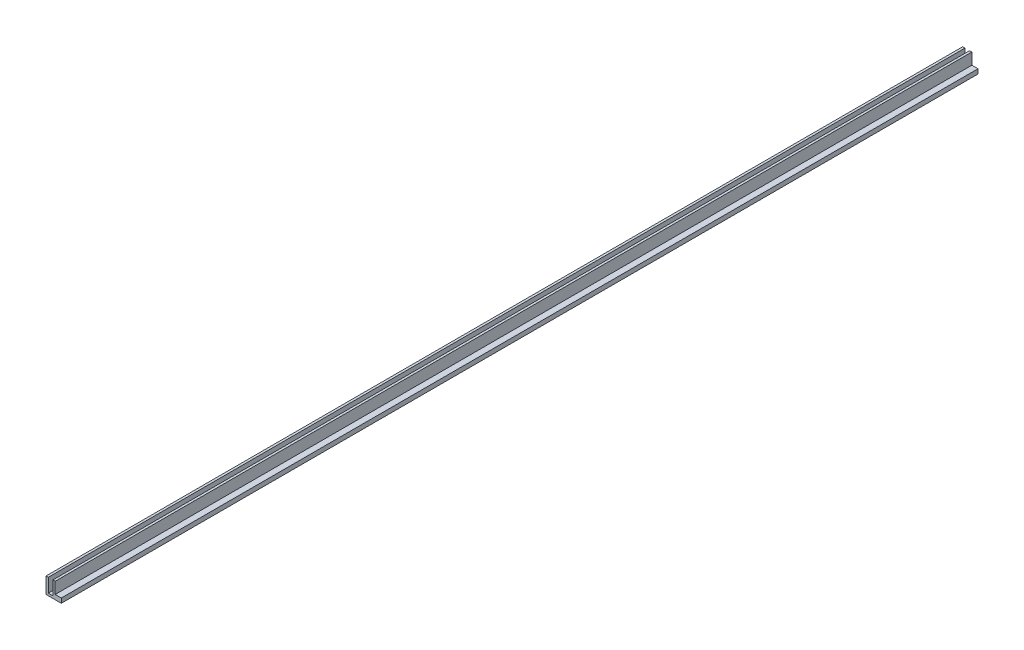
ISO-10303-21;
HEADER;
FILE_DESCRIPTION(('STEP AP214'),'2;1');
FILE_NAME('part.step','',(''),(''),'','','');
FILE_SCHEMA(('AUTOMOTIVE_DESIGN { 1 0 10303 214 1 1 1 1 }'));
ENDSEC;
DATA;
#1=APPLICATION_CONTEXT('core data for automotive mechanical design processes');
#2=APPLICATION_PROTOCOL_DEFINITION('international standard','automotive_design',2000,#1);
#3=PRODUCT_CONTEXT('',#1,'mechanical');
#4=PRODUCT('Part','Part','',(#3));
#5=PRODUCT_RELATED_PRODUCT_CATEGORY('part','',(#4));
#6=PRODUCT_DEFINITION_FORMATION('','',#4);
#7=PRODUCT_DEFINITION_CONTEXT('part definition',#1,'design');
#8=PRODUCT_DEFINITION('design','',#6,#7);
#9=PRODUCT_DEFINITION_SHAPE('','',#8);
#10=(LENGTH_UNIT() NAMED_UNIT(*) SI_UNIT(.MILLI.,.METRE.));
#11=(NAMED_UNIT(*) PLANE_ANGLE_UNIT() SI_UNIT($,.RADIAN.));
#12=(NAMED_UNIT(*) SI_UNIT($,.STERADIAN.) SOLID_ANGLE_UNIT());
#13=UNCERTAINTY_MEASURE_WITH_UNIT(LENGTH_MEASURE(1.E-05),#10,'distance_accuracy_value','');
#14=(GEOMETRIC_REPRESENTATION_CONTEXT(3) GLOBAL_UNCERTAINTY_ASSIGNED_CONTEXT((#13)) GLOBAL_UNIT_ASSIGNED_CONTEXT((#10,
#11,#12)) REPRESENTATION_CONTEXT('',''));
#15=CARTESIAN_POINT('',(0.,0.,0.));
#16=DIRECTION('',(0.,0.,1.));
#17=DIRECTION('',(1.,0.,0.));
#18=AXIS2_PLACEMENT_3D('',#15,#16,#17);
#19=CARTESIAN_POINT('',(0.,0.,1200.));
#20=DIRECTION('',(1.,0.,0.));
#21=DIRECTION('',(0.,0.,-1.));
#22=AXIS2_PLACEMENT_3D('',#19,#20,#21);
#23=PLANE('',#22);
#24=DIRECTION('',(0.,-1.,0.));
#25=VECTOR('',#24,1.);
#26=CARTESIAN_POINT('',(0.,0.,0.));
#27=LINE('',#26,#25);
#28=CARTESIAN_POINT('',(0.,21.,0.));
#29=VERTEX_POINT('',#28);
#30=CARTESIAN_POINT('',(0.,0.,0.));
#31=VERTEX_POINT('',#30);
#32=EDGE_CURVE('E106',#29,#31,#27,.T.);
#33=ORIENTED_EDGE('',*,*,#32,.T.);
#34=DIRECTION('',(0.,0.,-1.));
#35=VECTOR('',#34,1.);
#36=CARTESIAN_POINT('',(0.,0.,1200.));
#37=LINE('',#36,#35);
#38=CARTESIAN_POINT('',(0.,0.,1200.));
#39=VERTEX_POINT('',#38);
#40=EDGE_CURVE('E11',#39,#31,#37,.T.);
#41=ORIENTED_EDGE('',*,*,#40,.F.);
#42=DIRECTION('',(0.,-1.,0.));
#43=VECTOR('',#42,1.);
#44=CARTESIAN_POINT('',(0.,0.,1200.));
#45=LINE('',#44,#43);
#46=CARTESIAN_POINT('',(0.,21.,1200.));
#47=VERTEX_POINT('',#46);
#48=EDGE_CURVE('E137',#47,#39,#45,.T.);
#49=ORIENTED_EDGE('',*,*,#48,.F.);
#50=DIRECTION('',(0.,0.,-1.));
#51=VECTOR('',#50,1.);
#52=CARTESIAN_POINT('',(0.,21.,1200.));
#53=LINE('',#52,#51);
#54=EDGE_CURVE('E119',#47,#29,#53,.T.);
#55=ORIENTED_EDGE('',*,*,#54,.T.);
#56=EDGE_LOOP('',(#33,#41,#49,#55));
#57=FACE_BOUND('',#56,.T.);
#58=ADVANCED_FACE('F26',(#57),#23,.F.);
#59=CARTESIAN_POINT('',(0.,0.,1200.));
#60=DIRECTION('',(0.,1.,0.));
#61=DIRECTION('',(0.,0.,1.));
#62=AXIS2_PLACEMENT_3D('',#59,#60,#61);
#63=PLANE('',#62);
#64=DIRECTION('',(1.,0.,0.));
#65=VECTOR('',#64,1.);
#66=CARTESIAN_POINT('',(0.,0.,0.));
#67=LINE('',#66,#65);
#68=CARTESIAN_POINT('',(20.,0.,0.));
#69=VERTEX_POINT('',#68);
#70=EDGE_CURVE('E102',#31,#69,#67,.T.);
#71=ORIENTED_EDGE('',*,*,#70,.T.);
#72=DIRECTION('',(0.,0.,-1.));
#73=VECTOR('',#72,1.);
#74=CARTESIAN_POINT('',(20.,0.,1200.));
#75=LINE('',#74,#73);
#76=CARTESIAN_POINT('',(20.,0.,1200.));
#77=VERTEX_POINT('',#76);
#78=EDGE_CURVE('E33',#77,#69,#75,.T.);
#79=ORIENTED_EDGE('',*,*,#78,.F.);
#80=DIRECTION('',(1.,0.,0.));
#81=VECTOR('',#80,1.);
#82=CARTESIAN_POINT('',(0.,0.,1200.));
#83=LINE('',#82,#81);
#84=EDGE_CURVE('E115',#39,#77,#83,.T.);
#85=ORIENTED_EDGE('',*,*,#84,.F.);
#86=ORIENTED_EDGE('',*,*,#40,.T.);
#87=EDGE_LOOP('',(#71,#79,#85,#86));
#88=FACE_BOUND('',#87,.T.);
#89=ADVANCED_FACE('F114',(#88),#63,.F.);
#90=CARTESIAN_POINT('',(20.,6.,1200.));
#91=DIRECTION('',(-1.,0.,0.));
#92=DIRECTION('',(0.,-1.,0.));
#93=AXIS2_PLACEMENT_3D('',#90,#91,#92);
#94=PLANE('',#93);
#95=DIRECTION('',(0.,1.,0.));
#96=VECTOR('',#95,1.);
#97=CARTESIAN_POINT('',(20.,6.,0.));
#98=LINE('',#97,#96);
#99=CARTESIAN_POINT('',(20.,6.,0.));
#100=VERTEX_POINT('',#99);
#101=EDGE_CURVE('E108',#69,#100,#98,.T.);
#102=ORIENTED_EDGE('',*,*,#101,.T.);
#103=DIRECTION('',(0.,0.,-1.));
#104=VECTOR('',#103,1.);
#105=CARTESIAN_POINT('',(20.,6.,1200.));
#106=LINE('',#105,#104);
#107=CARTESIAN_POINT('',(20.,6.,1200.));
#108=VERTEX_POINT('',#107);
#109=EDGE_CURVE('E173',#108,#100,#106,.T.);
#110=ORIENTED_EDGE('',*,*,#109,.F.);
#111=DIRECTION('',(0.,1.,0.));
#112=VECTOR('',#111,1.);
#113=CARTESIAN_POINT('',(20.,6.,1200.));
#114=LINE('',#113,#112);
#115=EDGE_CURVE('E140',#77,#108,#114,.T.);
#116=ORIENTED_EDGE('',*,*,#115,.F.);
#117=ORIENTED_EDGE('',*,*,#78,.T.);
#118=EDGE_LOOP('',(#102,#110,#116,#117));
#119=FACE_BOUND('',#118,.T.);
#120=ADVANCED_FACE('F177',(#119),#94,.F.);
#121=CARTESIAN_POINT('',(12.,6.,1200.));
#122=DIRECTION('',(0.,-1.,0.));
#123=DIRECTION('',(0.,0.,-1.));
#124=AXIS2_PLACEMENT_3D('',#121,#122,#123);
#125=PLANE('',#124);
#126=DIRECTION('',(-1.,0.,0.));
#127=VECTOR('',#126,1.);
#128=CARTESIAN_POINT('',(12.,6.,0.));
#129=LINE('',#128,#127);
#130=CARTESIAN_POINT('',(12.,6.,0.));
#131=VERTEX_POINT('',#130);
#132=EDGE_CURVE('E123',#100,#131,#129,.T.);
#133=ORIENTED_EDGE('',*,*,#132,.T.);
#134=DIRECTION('',(0.,0.,-1.));
#135=VECTOR('',#134,1.);
#136=CARTESIAN_POINT('',(12.,6.,1200.));
#137=LINE('',#136,#135);
#138=CARTESIAN_POINT('',(12.,6.,1200.));
#139=VERTEX_POINT('',#138);
#140=EDGE_CURVE('E170',#139,#131,#137,.T.);
#141=ORIENTED_EDGE('',*,*,#140,.F.);
#142=DIRECTION('',(-1.,0.,0.));
#143=VECTOR('',#142,1.);
#144=CARTESIAN_POINT('',(12.,6.,1200.));
#145=LINE('',#144,#143);
#146=EDGE_CURVE('E142',#108,#139,#145,.T.);
#147=ORIENTED_EDGE('',*,*,#146,.F.);
#148=ORIENTED_EDGE('',*,*,#109,.T.);
#149=EDGE_LOOP('',(#133,#141,#147,#148));
#150=FACE_BOUND('',#149,.T.);
#151=ADVANCED_FACE('F185',(#150),#125,.F.);
#152=CARTESIAN_POINT('',(12.,21.,1200.));
#153=DIRECTION('',(-1.,0.,0.));
#154=DIRECTION('',(0.,-1.,0.));
#155=AXIS2_PLACEMENT_3D('',#152,#153,#154);
#156=PLANE('',#155);
#157=DIRECTION('',(0.,1.,0.));
#158=VECTOR('',#157,1.);
#159=CARTESIAN_POINT('',(12.,21.,0.));
#160=LINE('',#159,#158);
#161=CARTESIAN_POINT('',(12.,21.,0.));
#162=VERTEX_POINT('',#161);
#163=EDGE_CURVE('E125',#131,#162,#160,.T.);
#164=ORIENTED_EDGE('',*,*,#163,.T.);
#165=DIRECTION('',(0.,0.,-1.));
#166=VECTOR('',#165,1.);
#167=CARTESIAN_POINT('',(12.,21.,1200.));
#168=LINE('',#167,#166);
#169=CARTESIAN_POINT('',(12.,21.,1200.));
#170=VERTEX_POINT('',#169);
#171=EDGE_CURVE('E167',#170,#162,#168,.T.);
#172=ORIENTED_EDGE('',*,*,#171,.F.);
#173=DIRECTION('',(0.,1.,0.));
#174=VECTOR('',#173,1.);
#175=CARTESIAN_POINT('',(12.,21.,1200.));
#176=LINE('',#175,#174);
#177=EDGE_CURVE('E144',#139,#170,#176,.T.);
#178=ORIENTED_EDGE('',*,*,#177,.F.);
#179=ORIENTED_EDGE('',*,*,#140,.T.);
#180=EDGE_LOOP('',(#164,#172,#178,#179));
#181=FACE_BOUND('',#180,.T.);
#182=ADVANCED_FACE('F188',(#181),#156,.F.);
#183=CARTESIAN_POINT('',(9.00000000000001,21.,1200.));
#184=DIRECTION('',(0.,-1.,0.));
#185=DIRECTION('',(0.,0.,-1.));
#186=AXIS2_PLACEMENT_3D('',#183,#184,#185);
#187=PLANE('',#186);
#188=DIRECTION('',(-1.,0.,0.));
#189=VECTOR('',#188,1.);
#190=CARTESIAN_POINT('',(9.00000000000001,21.,0.));
#191=LINE('',#190,#189);
#192=CARTESIAN_POINT('',(9.00000000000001,21.,0.));
#193=VERTEX_POINT('',#192);
#194=EDGE_CURVE('E127',#162,#193,#191,.T.);
#195=ORIENTED_EDGE('',*,*,#194,.T.);
#196=DIRECTION('',(0.,0.,-1.));
#197=VECTOR('',#196,1.);
#198=CARTESIAN_POINT('',(9.00000000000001,21.,1200.));
#199=LINE('',#198,#197);
#200=CARTESIAN_POINT('',(9.00000000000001,21.,1200.));
#201=VERTEX_POINT('',#200);
#202=EDGE_CURVE('E164',#201,#193,#199,.T.);
#203=ORIENTED_EDGE('',*,*,#202,.F.);
#204=DIRECTION('',(-1.,0.,0.));
#205=VECTOR('',#204,1.);
#206=CARTESIAN_POINT('',(9.00000000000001,21.,1200.));
#207=LINE('',#206,#205);
#208=EDGE_CURVE('E146',#170,#201,#207,.T.);
#209=ORIENTED_EDGE('',*,*,#208,.F.);
#210=ORIENTED_EDGE('',*,*,#171,.T.);
#211=EDGE_LOOP('',(#195,#203,#209,#210));
#212=FACE_BOUND('',#211,.T.);
#213=ADVANCED_FACE('F193',(#212),#187,.F.);
#214=CARTESIAN_POINT('',(9.00000000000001,3.,1200.));
#215=DIRECTION('',(1.,0.,0.));
#216=DIRECTION('',(0.,0.,-1.));
#217=AXIS2_PLACEMENT_3D('',#214,#215,#216);
#218=PLANE('',#217);
#219=DIRECTION('',(0.,-1.,0.));
#220=VECTOR('',#219,1.);
#221=CARTESIAN_POINT('',(9.00000000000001,3.,0.));
#222=LINE('',#221,#220);
#223=CARTESIAN_POINT('',(9.00000000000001,3.,0.));
#224=VERTEX_POINT('',#223);
#225=EDGE_CURVE('E129',#193,#224,#222,.T.);
#226=ORIENTED_EDGE('',*,*,#225,.T.);
#227=DIRECTION('',(0.,0.,-1.));
#228=VECTOR('',#227,1.);
#229=CARTESIAN_POINT('',(9.00000000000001,3.,1200.));
#230=LINE('',#229,#228);
#231=CARTESIAN_POINT('',(9.00000000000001,3.,1200.));
#232=VERTEX_POINT('',#231);
#233=EDGE_CURVE('E161',#232,#224,#230,.T.);
#234=ORIENTED_EDGE('',*,*,#233,.F.);
#235=DIRECTION('',(0.,-1.,0.));
#236=VECTOR('',#235,1.);
#237=CARTESIAN_POINT('',(9.00000000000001,3.,1200.));
#238=LINE('',#237,#236);
#239=EDGE_CURVE('E148',#201,#232,#238,.T.);
#240=ORIENTED_EDGE('',*,*,#239,.F.);
#241=ORIENTED_EDGE('',*,*,#202,.T.);
#242=EDGE_LOOP('',(#226,#234,#240,#241));
#243=FACE_BOUND('',#242,.T.);
#244=ADVANCED_FACE('F199',(#243),#218,.F.);
#245=CARTESIAN_POINT('',(3.00000000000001,3.,1200.));
#246=DIRECTION('',(0.,-1.,0.));
#247=DIRECTION('',(0.,0.,-1.));
#248=AXIS2_PLACEMENT_3D('',#245,#246,#247);
#249=PLANE('',#248);
#250=DIRECTION('',(-1.,0.,0.));
#251=VECTOR('',#250,1.);
#252=CARTESIAN_POINT('',(3.00000000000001,3.,0.));
#253=LINE('',#252,#251);
#254=CARTESIAN_POINT('',(3.00000000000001,3.,0.));
#255=VERTEX_POINT('',#254);
#256=EDGE_CURVE('E131',#224,#255,#253,.T.);
#257=ORIENTED_EDGE('',*,*,#256,.T.);
#258=DIRECTION('',(0.,0.,-1.));
#259=VECTOR('',#258,1.);
#260=CARTESIAN_POINT('',(3.00000000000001,3.,1200.));
#261=LINE('',#260,#259);
#262=CARTESIAN_POINT('',(3.00000000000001,3.,1200.));
#263=VERTEX_POINT('',#262);
#264=EDGE_CURVE('E158',#263,#255,#261,.T.);
#265=ORIENTED_EDGE('',*,*,#264,.F.);
#266=DIRECTION('',(-1.,0.,0.));
#267=VECTOR('',#266,1.);
#268=CARTESIAN_POINT('',(3.00000000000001,3.,1200.));
#269=LINE('',#268,#267);
#270=EDGE_CURVE('E150',#232,#263,#269,.T.);
#271=ORIENTED_EDGE('',*,*,#270,.F.);
#272=ORIENTED_EDGE('',*,*,#233,.T.);
#273=EDGE_LOOP('',(#257,#265,#271,#272));
#274=FACE_BOUND('',#273,.T.);
#275=ADVANCED_FACE('F203',(#274),#249,.F.);
#276=CARTESIAN_POINT('',(3.,21.,1200.));
#277=DIRECTION('',(-1.,0.,0.));
#278=DIRECTION('',(0.,-1.,0.));
#279=AXIS2_PLACEMENT_3D('',#276,#277,#278);
#280=PLANE('',#279);
#281=DIRECTION('',(0.,1.,0.));
#282=VECTOR('',#281,1.);
#283=CARTESIAN_POINT('',(3.,21.,0.));
#284=LINE('',#283,#282);
#285=CARTESIAN_POINT('',(3.,21.,0.));
#286=VERTEX_POINT('',#285);
#287=EDGE_CURVE('E133',#255,#286,#284,.T.);
#288=ORIENTED_EDGE('',*,*,#287,.T.);
#289=DIRECTION('',(0.,0.,-1.));
#290=VECTOR('',#289,1.);
#291=CARTESIAN_POINT('',(3.,21.,1200.));
#292=LINE('',#291,#290);
#293=CARTESIAN_POINT('',(3.,21.,1200.));
#294=VERTEX_POINT('',#293);
#295=EDGE_CURVE('E155',#294,#286,#292,.T.);
#296=ORIENTED_EDGE('',*,*,#295,.F.);
#297=DIRECTION('',(0.,1.,0.));
#298=VECTOR('',#297,1.);
#299=CARTESIAN_POINT('',(3.,21.,1200.));
#300=LINE('',#299,#298);
#301=EDGE_CURVE('E45',#263,#294,#300,.T.);
#302=ORIENTED_EDGE('',*,*,#301,.F.);
#303=ORIENTED_EDGE('',*,*,#264,.T.);
#304=EDGE_LOOP('',(#288,#296,#302,#303));
#305=FACE_BOUND('',#304,.T.);
#306=ADVANCED_FACE('F206',(#305),#280,.F.);
#307=CARTESIAN_POINT('',(0.,21.,1200.));
#308=DIRECTION('',(0.,-1.,0.));
#309=DIRECTION('',(0.,0.,-1.));
#310=AXIS2_PLACEMENT_3D('',#307,#308,#309);
#311=PLANE('',#310);
#312=DIRECTION('',(-1.,0.,0.));
#313=VECTOR('',#312,1.);
#314=CARTESIAN_POINT('',(0.,21.,0.));
#315=LINE('',#314,#313);
#316=EDGE_CURVE('E135',#286,#29,#315,.T.);
#317=ORIENTED_EDGE('',*,*,#316,.T.);
#318=ORIENTED_EDGE('',*,*,#54,.F.);
#319=DIRECTION('',(-1.,0.,0.));
#320=VECTOR('',#319,1.);
#321=CARTESIAN_POINT('',(0.,21.,1200.));
#322=LINE('',#321,#320);
#323=EDGE_CURVE('E40',#294,#47,#322,.T.);
#324=ORIENTED_EDGE('',*,*,#323,.F.);
#325=ORIENTED_EDGE('',*,*,#295,.T.);
#326=EDGE_LOOP('',(#317,#318,#324,#325));
#327=FACE_BOUND('',#326,.T.);
#328=ADVANCED_FACE('F208',(#327),#311,.F.);
#329=CARTESIAN_POINT('',(0.,21.,1200.));
#330=DIRECTION('',(0.,0.,-1.));
#331=DIRECTION('',(-1.,0.,0.));
#332=AXIS2_PLACEMENT_3D('',#329,#330,#331);
#333=PLANE('',#332);
#334=ORIENTED_EDGE('',*,*,#48,.T.);
#335=ORIENTED_EDGE('',*,*,#84,.T.);
#336=ORIENTED_EDGE('',*,*,#115,.T.);
#337=ORIENTED_EDGE('',*,*,#146,.T.);
#338=ORIENTED_EDGE('',*,*,#177,.T.);
#339=ORIENTED_EDGE('',*,*,#208,.T.);
#340=ORIENTED_EDGE('',*,*,#239,.T.);
#341=ORIENTED_EDGE('',*,*,#270,.T.);
#342=ORIENTED_EDGE('',*,*,#301,.T.);
#343=ORIENTED_EDGE('',*,*,#323,.T.);
#344=EDGE_LOOP('',(#334,#335,#336,#337,#338,#339,#340,#341,#342,#343));
#345=FACE_BOUND('',#344,.T.);
#346=ADVANCED_FACE('F180',(#345),#333,.F.);
#347=CARTESIAN_POINT('',(0.,21.,0.));
#348=DIRECTION('',(0.,0.,-1.));
#349=DIRECTION('',(-1.,0.,0.));
#350=AXIS2_PLACEMENT_3D('',#347,#348,#349);
#351=PLANE('',#350);
#352=ORIENTED_EDGE('',*,*,#32,.F.);
#353=ORIENTED_EDGE('',*,*,#316,.F.);
#354=ORIENTED_EDGE('',*,*,#287,.F.);
#355=ORIENTED_EDGE('',*,*,#256,.F.);
#356=ORIENTED_EDGE('',*,*,#225,.F.);
#357=ORIENTED_EDGE('',*,*,#194,.F.);
#358=ORIENTED_EDGE('',*,*,#163,.F.);
#359=ORIENTED_EDGE('',*,*,#132,.F.);
#360=ORIENTED_EDGE('',*,*,#101,.F.);
#361=ORIENTED_EDGE('',*,*,#70,.F.);
#362=EDGE_LOOP('',(#352,#353,#354,#355,#356,#357,#358,#359,#360,#361));
#363=FACE_BOUND('',#362,.T.);
#364=ADVANCED_FACE('F103',(#363),#351,.T.);
#365=CLOSED_SHELL('',(#58,#89,#120,#151,#182,#213,#244,#275,#306,#328,#346,#364));
#366=MANIFOLD_SOLID_BREP('B2',#365);
#367=ADVANCED_BREP_SHAPE_REPRESENTATION('',(#18,#366),#14);
#368=SHAPE_DEFINITION_REPRESENTATION(#9,#367);
ENDSEC;
END-ISO-10303-21;
